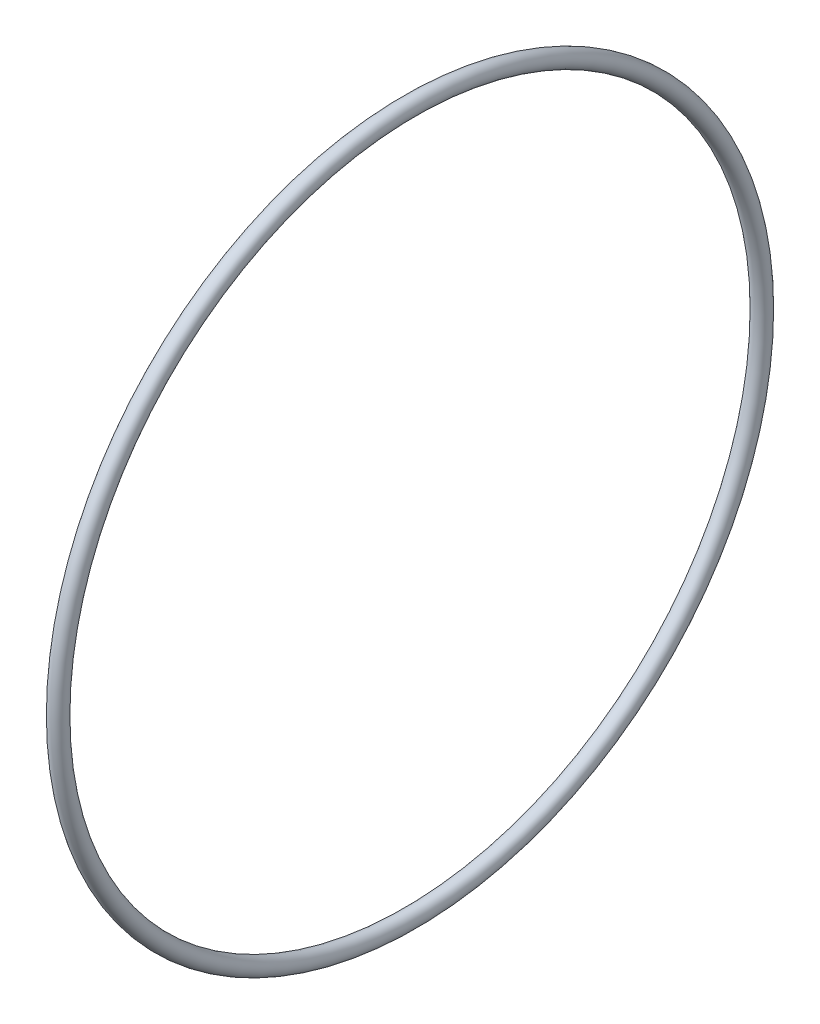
ISO-10303-21;
HEADER;
FILE_DESCRIPTION(('STEP AP214'),'2;1');
FILE_NAME('part.step','',(''),(''),'','','');
FILE_SCHEMA(('AUTOMOTIVE_DESIGN { 1 0 10303 214 1 1 1 1 }'));
ENDSEC;
DATA;
#1=APPLICATION_CONTEXT('core data for automotive mechanical design processes');
#2=APPLICATION_PROTOCOL_DEFINITION('international standard','automotive_design',2000,#1);
#3=PRODUCT_CONTEXT('',#1,'mechanical');
#4=PRODUCT('Part','Part','',(#3));
#5=PRODUCT_RELATED_PRODUCT_CATEGORY('part','',(#4));
#6=PRODUCT_DEFINITION_FORMATION('','',#4);
#7=PRODUCT_DEFINITION_CONTEXT('part definition',#1,'design');
#8=PRODUCT_DEFINITION('design','',#6,#7);
#9=PRODUCT_DEFINITION_SHAPE('','',#8);
#10=(LENGTH_UNIT() NAMED_UNIT(*) SI_UNIT(.MILLI.,.METRE.));
#11=(NAMED_UNIT(*) PLANE_ANGLE_UNIT() SI_UNIT($,.RADIAN.));
#12=(NAMED_UNIT(*) SI_UNIT($,.STERADIAN.) SOLID_ANGLE_UNIT());
#13=UNCERTAINTY_MEASURE_WITH_UNIT(LENGTH_MEASURE(1.E-05),#10,'distance_accuracy_value','');
#14=(GEOMETRIC_REPRESENTATION_CONTEXT(3) GLOBAL_UNCERTAINTY_ASSIGNED_CONTEXT((#13)) GLOBAL_UNIT_ASSIGNED_CONTEXT((#10,
#11,#12)) REPRESENTATION_CONTEXT('',''));
#15=CARTESIAN_POINT('',(0.,0.,0.));
#16=DIRECTION('',(0.,0.,1.));
#17=DIRECTION('',(1.,0.,0.));
#18=AXIS2_PLACEMENT_3D('',#15,#16,#17);
#19=CARTESIAN_POINT('',(2.44249065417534E-12,0.,1.2490009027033E-13));
#20=DIRECTION('',(-1.00000000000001,0.,0.));
#21=DIRECTION('',(0.,0.,1.));
#22=AXIS2_PLACEMENT_3D('',#19,#20,#21);
#23=TOROIDAL_SURFACE('',#22,55.118,1.30404114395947);
#24=CARTESIAN_POINT('',(2.45482311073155E-12,0.,56.4220411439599));
#25=VERTEX_POINT('',#24);
#26=VERTEX_LOOP('',#25);
#27=FACE_BOUND('',#26,.T.);
#28=ADVANCED_FACE('F28',(#27),#23,.T.);
#29=CLOSED_SHELL('',(#28));
#30=MANIFOLD_SOLID_BREP('B2',#29);
#31=ADVANCED_BREP_SHAPE_REPRESENTATION('',(#18,#30),#14);
#32=SHAPE_DEFINITION_REPRESENTATION(#9,#31);
ENDSEC;
END-ISO-10303-21;
